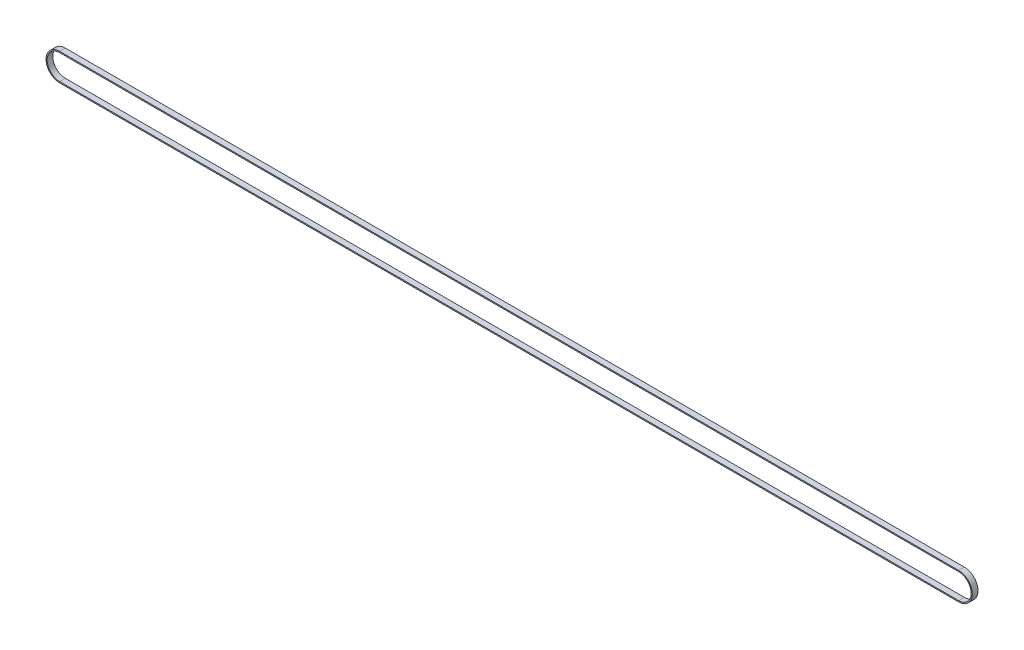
ISO-10303-21;
HEADER;
FILE_DESCRIPTION(('STEP AP214'),'2;1');
FILE_NAME('part.step','',(''),(''),'','','');
FILE_SCHEMA(('AUTOMOTIVE_DESIGN { 1 0 10303 214 1 1 1 1 }'));
ENDSEC;
DATA;
#1=APPLICATION_CONTEXT('core data for automotive mechanical design processes');
#2=APPLICATION_PROTOCOL_DEFINITION('international standard','automotive_design',2000,#1);
#3=PRODUCT_CONTEXT('',#1,'mechanical');
#4=PRODUCT('Part','Part','',(#3));
#5=PRODUCT_RELATED_PRODUCT_CATEGORY('part','',(#4));
#6=PRODUCT_DEFINITION_FORMATION('','',#4);
#7=PRODUCT_DEFINITION_CONTEXT('part definition',#1,'design');
#8=PRODUCT_DEFINITION('design','',#6,#7);
#9=PRODUCT_DEFINITION_SHAPE('','',#8);
#10=(LENGTH_UNIT() NAMED_UNIT(*) SI_UNIT(.MILLI.,.METRE.));
#11=(NAMED_UNIT(*) PLANE_ANGLE_UNIT() SI_UNIT($,.RADIAN.));
#12=(NAMED_UNIT(*) SI_UNIT($,.STERADIAN.) SOLID_ANGLE_UNIT());
#13=UNCERTAINTY_MEASURE_WITH_UNIT(LENGTH_MEASURE(1.E-05),#10,'distance_accuracy_value','');
#14=(GEOMETRIC_REPRESENTATION_CONTEXT(3) GLOBAL_UNCERTAINTY_ASSIGNED_CONTEXT((#13)) GLOBAL_UNIT_ASSIGNED_CONTEXT((#10,
#11,#12)) REPRESENTATION_CONTEXT('',''));
#15=CARTESIAN_POINT('',(0.,0.,0.));
#16=DIRECTION('',(0.,0.,1.));
#17=DIRECTION('',(1.,0.,0.));
#18=AXIS2_PLACEMENT_3D('',#15,#16,#17);
#19=CARTESIAN_POINT('',(0.,24.,10.));
#20=DIRECTION('',(0.,-1.,0.));
#21=DIRECTION('',(0.,0.,-1.));
#22=AXIS2_PLACEMENT_3D('',#19,#20,#21);
#23=PLANE('',#22);
#24=DIRECTION('',(0.,0.,-1.));
#25=VECTOR('',#24,1.);
#26=CARTESIAN_POINT('',(0.,24.,10.));
#27=LINE('',#26,#25);
#28=CARTESIAN_POINT('',(0.,24.,10.));
#29=VERTEX_POINT('',#28);
#30=CARTESIAN_POINT('',(0.,24.,0.));
#31=VERTEX_POINT('',#30);
#32=EDGE_CURVE('E116',#29,#31,#27,.T.);
#33=ORIENTED_EDGE('',*,*,#32,.F.);
#34=DIRECTION('',(1.,0.,0.));
#35=VECTOR('',#34,1.);
#36=CARTESIAN_POINT('',(0.,24.,10.));
#37=LINE('',#36,#35);
#38=CARTESIAN_POINT('',(1580.,24.,10.));
#39=VERTEX_POINT('',#38);
#40=EDGE_CURVE('E74',#39,#29,#37,.F.);
#41=ORIENTED_EDGE('',*,*,#40,.F.);
#42=DIRECTION('',(0.,0.,-1.));
#43=VECTOR('',#42,1.);
#44=CARTESIAN_POINT('',(1580.,24.,10.));
#45=LINE('',#44,#43);
#46=CARTESIAN_POINT('',(1580.,24.,0.));
#47=VERTEX_POINT('',#46);
#48=EDGE_CURVE('E118',#47,#39,#45,.F.);
#49=ORIENTED_EDGE('',*,*,#48,.F.);
#50=DIRECTION('',(1.,0.,0.));
#51=VECTOR('',#50,1.);
#52=CARTESIAN_POINT('',(0.,24.,0.));
#53=LINE('',#52,#51);
#54=EDGE_CURVE('E126',#47,#31,#53,.F.);
#55=ORIENTED_EDGE('',*,*,#54,.T.);
#56=EDGE_LOOP('',(#33,#41,#49,#55));
#57=FACE_BOUND('',#56,.T.);
#58=ADVANCED_FACE('F17',(#57),#23,.F.);
#59=CARTESIAN_POINT('',(0.,22.,10.));
#60=DIRECTION('',(0.,-1.,0.));
#61=DIRECTION('',(0.,0.,-1.));
#62=AXIS2_PLACEMENT_3D('',#59,#60,#61);
#63=PLANE('',#62);
#64=DIRECTION('',(1.,0.,0.));
#65=VECTOR('',#64,1.);
#66=CARTESIAN_POINT('',(0.,22.,10.));
#67=LINE('',#66,#65);
#68=CARTESIAN_POINT('',(0.,22.,10.));
#69=VERTEX_POINT('',#68);
#70=CARTESIAN_POINT('',(1580.,22.,10.));
#71=VERTEX_POINT('',#70);
#72=EDGE_CURVE('E97',#69,#71,#67,.T.);
#73=ORIENTED_EDGE('',*,*,#72,.F.);
#74=DIRECTION('',(0.,0.,-1.));
#75=VECTOR('',#74,1.);
#76=CARTESIAN_POINT('',(0.,22.,10.));
#77=LINE('',#76,#75);
#78=CARTESIAN_POINT('',(0.,22.,0.));
#79=VERTEX_POINT('',#78);
#80=EDGE_CURVE('E79',#69,#79,#77,.T.);
#81=ORIENTED_EDGE('',*,*,#80,.T.);
#82=DIRECTION('',(1.,0.,0.));
#83=VECTOR('',#82,1.);
#84=CARTESIAN_POINT('',(0.,22.,0.));
#85=LINE('',#84,#83);
#86=CARTESIAN_POINT('',(1580.,22.,0.));
#87=VERTEX_POINT('',#86);
#88=EDGE_CURVE('E124',#79,#87,#85,.T.);
#89=ORIENTED_EDGE('',*,*,#88,.T.);
#90=DIRECTION('',(0.,0.,-1.));
#91=VECTOR('',#90,1.);
#92=CARTESIAN_POINT('',(1580.,22.,10.));
#93=LINE('',#92,#91);
#94=EDGE_CURVE('E113',#87,#71,#93,.F.);
#95=ORIENTED_EDGE('',*,*,#94,.T.);
#96=EDGE_LOOP('',(#73,#81,#89,#95));
#97=FACE_BOUND('',#96,.T.);
#98=ADVANCED_FACE('F137',(#97),#63,.T.);
#99=CARTESIAN_POINT('',(1580.,0.,10.));
#100=DIRECTION('',(0.,0.,-1.));
#101=DIRECTION('',(-1.,0.,0.));
#102=AXIS2_PLACEMENT_3D('',#99,#100,#101);
#103=CYLINDRICAL_SURFACE('',#102,22.);
#104=DIRECTION('',(0.,0.,1.));
#105=VECTOR('',#104,1.);
#106=CARTESIAN_POINT('',(1580.,-22.,10.));
#107=LINE('',#106,#105);
#108=CARTESIAN_POINT('',(1580.,-22.,10.));
#109=VERTEX_POINT('',#108);
#110=CARTESIAN_POINT('',(1580.,-22.,0.));
#111=VERTEX_POINT('',#110);
#112=EDGE_CURVE('E110',#109,#111,#107,.F.);
#113=ORIENTED_EDGE('',*,*,#112,.F.);
#114=CARTESIAN_POINT('',(1580.,0.,10.));
#115=DIRECTION('',(0.,0.,-1.));
#116=DIRECTION('',(-1.,0.,0.));
#117=AXIS2_PLACEMENT_3D('',#114,#115,#116);
#118=CIRCLE('',#117,22.);
#119=EDGE_CURVE('E99',#71,#109,#118,.T.);
#120=ORIENTED_EDGE('',*,*,#119,.F.);
#121=ORIENTED_EDGE('',*,*,#94,.F.);
#122=CARTESIAN_POINT('',(1580.,0.,0.));
#123=DIRECTION('',(0.,0.,-1.));
#124=DIRECTION('',(-1.,0.,0.));
#125=AXIS2_PLACEMENT_3D('',#122,#123,#124);
#126=CIRCLE('',#125,22.);
#127=EDGE_CURVE('E121',#87,#111,#126,.T.);
#128=ORIENTED_EDGE('',*,*,#127,.T.);
#129=EDGE_LOOP('',(#113,#120,#121,#128));
#130=FACE_BOUND('',#129,.T.);
#131=ADVANCED_FACE('F146',(#130),#103,.F.);
#132=CARTESIAN_POINT('',(0.,-22.,10.));
#133=DIRECTION('',(0.,1.,0.));
#134=DIRECTION('',(0.,0.,1.));
#135=AXIS2_PLACEMENT_3D('',#132,#133,#134);
#136=PLANE('',#135);
#137=DIRECTION('',(1.,0.,0.));
#138=VECTOR('',#137,1.);
#139=CARTESIAN_POINT('',(0.,-22.,10.));
#140=LINE('',#139,#138);
#141=CARTESIAN_POINT('',(0.,-22.,10.));
#142=VERTEX_POINT('',#141);
#143=EDGE_CURVE('E101',#109,#142,#140,.F.);
#144=ORIENTED_EDGE('',*,*,#143,.F.);
#145=ORIENTED_EDGE('',*,*,#112,.T.);
#146=DIRECTION('',(1.,0.,0.));
#147=VECTOR('',#146,1.);
#148=CARTESIAN_POINT('',(0.,-22.,0.));
#149=LINE('',#148,#147);
#150=CARTESIAN_POINT('',(0.,-22.,0.));
#151=VERTEX_POINT('',#150);
#152=EDGE_CURVE('E93',#111,#151,#149,.F.);
#153=ORIENTED_EDGE('',*,*,#152,.T.);
#154=DIRECTION('',(0.,0.,-1.));
#155=VECTOR('',#154,1.);
#156=CARTESIAN_POINT('',(0.,-22.,10.));
#157=LINE('',#156,#155);
#158=EDGE_CURVE('E107',#151,#142,#157,.F.);
#159=ORIENTED_EDGE('',*,*,#158,.T.);
#160=EDGE_LOOP('',(#144,#145,#153,#159));
#161=FACE_BOUND('',#160,.T.);
#162=ADVANCED_FACE('F148',(#161),#136,.T.);
#163=CARTESIAN_POINT('',(0.,0.,10.));
#164=DIRECTION('',(0.,0.,-1.));
#165=DIRECTION('',(-1.,0.,0.));
#166=AXIS2_PLACEMENT_3D('',#163,#164,#165);
#167=CYLINDRICAL_SURFACE('',#166,22.);
#168=CARTESIAN_POINT('',(0.,0.,10.));
#169=DIRECTION('',(0.,0.,-1.));
#170=DIRECTION('',(-1.,0.,0.));
#171=AXIS2_PLACEMENT_3D('',#168,#169,#170);
#172=CIRCLE('',#171,22.);
#173=EDGE_CURVE('E100',#142,#69,#172,.T.);
#174=ORIENTED_EDGE('',*,*,#173,.F.);
#175=ORIENTED_EDGE('',*,*,#158,.F.);
#176=CARTESIAN_POINT('',(0.,0.,0.));
#177=DIRECTION('',(0.,0.,-1.));
#178=DIRECTION('',(-1.,0.,0.));
#179=AXIS2_PLACEMENT_3D('',#176,#177,#178);
#180=CIRCLE('',#179,22.);
#181=EDGE_CURVE('E90',#151,#79,#180,.T.);
#182=ORIENTED_EDGE('',*,*,#181,.T.);
#183=ORIENTED_EDGE('',*,*,#80,.F.);
#184=EDGE_LOOP('',(#174,#175,#182,#183));
#185=FACE_BOUND('',#184,.T.);
#186=ADVANCED_FACE('F152',(#185),#167,.F.);
#187=CARTESIAN_POINT('',(0.,0.,10.));
#188=DIRECTION('',(0.,0.,-1.));
#189=DIRECTION('',(-1.,0.,0.));
#190=AXIS2_PLACEMENT_3D('',#187,#188,#189);
#191=CYLINDRICAL_SURFACE('',#190,24.);
#192=CARTESIAN_POINT('',(0.,0.,0.));
#193=DIRECTION('',(0.,0.,-1.));
#194=DIRECTION('',(-1.,0.,0.));
#195=AXIS2_PLACEMENT_3D('',#192,#193,#194);
#196=CIRCLE('',#195,24.);
#197=CARTESIAN_POINT('',(0.,-24.,0.));
#198=VERTEX_POINT('',#197);
#199=EDGE_CURVE('E89',#31,#198,#196,.F.);
#200=ORIENTED_EDGE('',*,*,#199,.T.);
#201=DIRECTION('',(0.,0.,1.));
#202=VECTOR('',#201,1.);
#203=CARTESIAN_POINT('',(0.,-24.,10.));
#204=LINE('',#203,#202);
#205=CARTESIAN_POINT('',(0.,-24.,10.));
#206=VERTEX_POINT('',#205);
#207=EDGE_CURVE('E84',#198,#206,#204,.T.);
#208=ORIENTED_EDGE('',*,*,#207,.T.);
#209=CARTESIAN_POINT('',(0.,0.,10.));
#210=DIRECTION('',(0.,0.,-1.));
#211=DIRECTION('',(-1.,0.,0.));
#212=AXIS2_PLACEMENT_3D('',#209,#210,#211);
#213=CIRCLE('',#212,24.);
#214=EDGE_CURVE('E20',#29,#206,#213,.F.);
#215=ORIENTED_EDGE('',*,*,#214,.F.);
#216=ORIENTED_EDGE('',*,*,#32,.T.);
#217=EDGE_LOOP('',(#200,#208,#215,#216));
#218=FACE_BOUND('',#217,.T.);
#219=ADVANCED_FACE('F87',(#218),#191,.T.);
#220=CARTESIAN_POINT('',(0.,0.,10.));
#221=DIRECTION('',(0.,0.,1.));
#222=DIRECTION('',(1.,0.,0.));
#223=AXIS2_PLACEMENT_3D('',#220,#221,#222);
#224=PLANE('',#223);
#225=ORIENTED_EDGE('',*,*,#72,.T.);
#226=ORIENTED_EDGE('',*,*,#119,.T.);
#227=ORIENTED_EDGE('',*,*,#143,.T.);
#228=ORIENTED_EDGE('',*,*,#173,.T.);
#229=EDGE_LOOP('',(#225,#226,#227,#228));
#230=FACE_BOUND('',#229,.T.);
#231=CARTESIAN_POINT('',(1580.,0.,10.));
#232=DIRECTION('',(0.,0.,-1.));
#233=DIRECTION('',(-1.,0.,0.));
#234=AXIS2_PLACEMENT_3D('',#231,#232,#233);
#235=CIRCLE('',#234,24.);
#236=CARTESIAN_POINT('',(1580.,-24.,10.));
#237=VERTEX_POINT('',#236);
#238=EDGE_CURVE('E119',#39,#237,#235,.T.);
#239=ORIENTED_EDGE('',*,*,#238,.F.);
#240=ORIENTED_EDGE('',*,*,#40,.T.);
#241=ORIENTED_EDGE('',*,*,#214,.T.);
#242=DIRECTION('',(1.,0.,0.));
#243=VECTOR('',#242,1.);
#244=CARTESIAN_POINT('',(0.,-24.,10.));
#245=LINE('',#244,#243);
#246=EDGE_CURVE('E72',#206,#237,#245,.T.);
#247=ORIENTED_EDGE('',*,*,#246,.T.);
#248=EDGE_LOOP('',(#239,#240,#241,#247));
#249=FACE_BOUND('',#248,.T.);
#250=ADVANCED_FACE('F71',(#230,#249),#224,.T.);
#251=CARTESIAN_POINT('',(1580.,0.,10.));
#252=DIRECTION('',(0.,0.,-1.));
#253=DIRECTION('',(-1.,0.,0.));
#254=AXIS2_PLACEMENT_3D('',#251,#252,#253);
#255=CYLINDRICAL_SURFACE('',#254,24.);
#256=ORIENTED_EDGE('',*,*,#238,.T.);
#257=DIRECTION('',(0.,0.,1.));
#258=VECTOR('',#257,1.);
#259=CARTESIAN_POINT('',(1580.,-24.,10.));
#260=LINE('',#259,#258);
#261=CARTESIAN_POINT('',(1580.,-24.,0.));
#262=VERTEX_POINT('',#261);
#263=EDGE_CURVE('E26',#237,#262,#260,.F.);
#264=ORIENTED_EDGE('',*,*,#263,.T.);
#265=CARTESIAN_POINT('',(1580.,0.,0.));
#266=DIRECTION('',(0.,0.,-1.));
#267=DIRECTION('',(-1.,0.,0.));
#268=AXIS2_PLACEMENT_3D('',#265,#266,#267);
#269=CIRCLE('',#268,24.);
#270=EDGE_CURVE('E34',#262,#47,#269,.F.);
#271=ORIENTED_EDGE('',*,*,#270,.T.);
#272=ORIENTED_EDGE('',*,*,#48,.T.);
#273=EDGE_LOOP('',(#256,#264,#271,#272));
#274=FACE_BOUND('',#273,.T.);
#275=ADVANCED_FACE('F165',(#274),#255,.T.);
#276=CARTESIAN_POINT('',(0.,0.,0.));
#277=DIRECTION('',(0.,0.,1.));
#278=DIRECTION('',(1.,0.,0.));
#279=AXIS2_PLACEMENT_3D('',#276,#277,#278);
#280=PLANE('',#279);
#281=ORIENTED_EDGE('',*,*,#181,.F.);
#282=ORIENTED_EDGE('',*,*,#152,.F.);
#283=ORIENTED_EDGE('',*,*,#127,.F.);
#284=ORIENTED_EDGE('',*,*,#88,.F.);
#285=EDGE_LOOP('',(#281,#282,#283,#284));
#286=FACE_BOUND('',#285,.T.);
#287=ORIENTED_EDGE('',*,*,#54,.F.);
#288=ORIENTED_EDGE('',*,*,#270,.F.);
#289=DIRECTION('',(1.,0.,0.));
#290=VECTOR('',#289,1.);
#291=CARTESIAN_POINT('',(0.,-24.,0.));
#292=LINE('',#291,#290);
#293=EDGE_CURVE('E11',#262,#198,#292,.F.);
#294=ORIENTED_EDGE('',*,*,#293,.T.);
#295=ORIENTED_EDGE('',*,*,#199,.F.);
#296=EDGE_LOOP('',(#287,#288,#294,#295));
#297=FACE_BOUND('',#296,.T.);
#298=ADVANCED_FACE('F160',(#286,#297),#280,.F.);
#299=CARTESIAN_POINT('',(0.,-24.,10.));
#300=DIRECTION('',(0.,1.,0.));
#301=DIRECTION('',(0.,0.,1.));
#302=AXIS2_PLACEMENT_3D('',#299,#300,#301);
#303=PLANE('',#302);
#304=ORIENTED_EDGE('',*,*,#263,.F.);
#305=ORIENTED_EDGE('',*,*,#246,.F.);
#306=ORIENTED_EDGE('',*,*,#207,.F.);
#307=ORIENTED_EDGE('',*,*,#293,.F.);
#308=EDGE_LOOP('',(#304,#305,#306,#307));
#309=FACE_BOUND('',#308,.T.);
#310=ADVANCED_FACE('F83',(#309),#303,.F.);
#311=CLOSED_SHELL('',(#58,#98,#131,#162,#186,#219,#250,#275,#298,#310));
#312=MANIFOLD_SOLID_BREP('B1',#311);
#313=ADVANCED_BREP_SHAPE_REPRESENTATION('',(#18,#312),#14);
#314=SHAPE_DEFINITION_REPRESENTATION(#9,#313);
ENDSEC;
END-ISO-10303-21;
